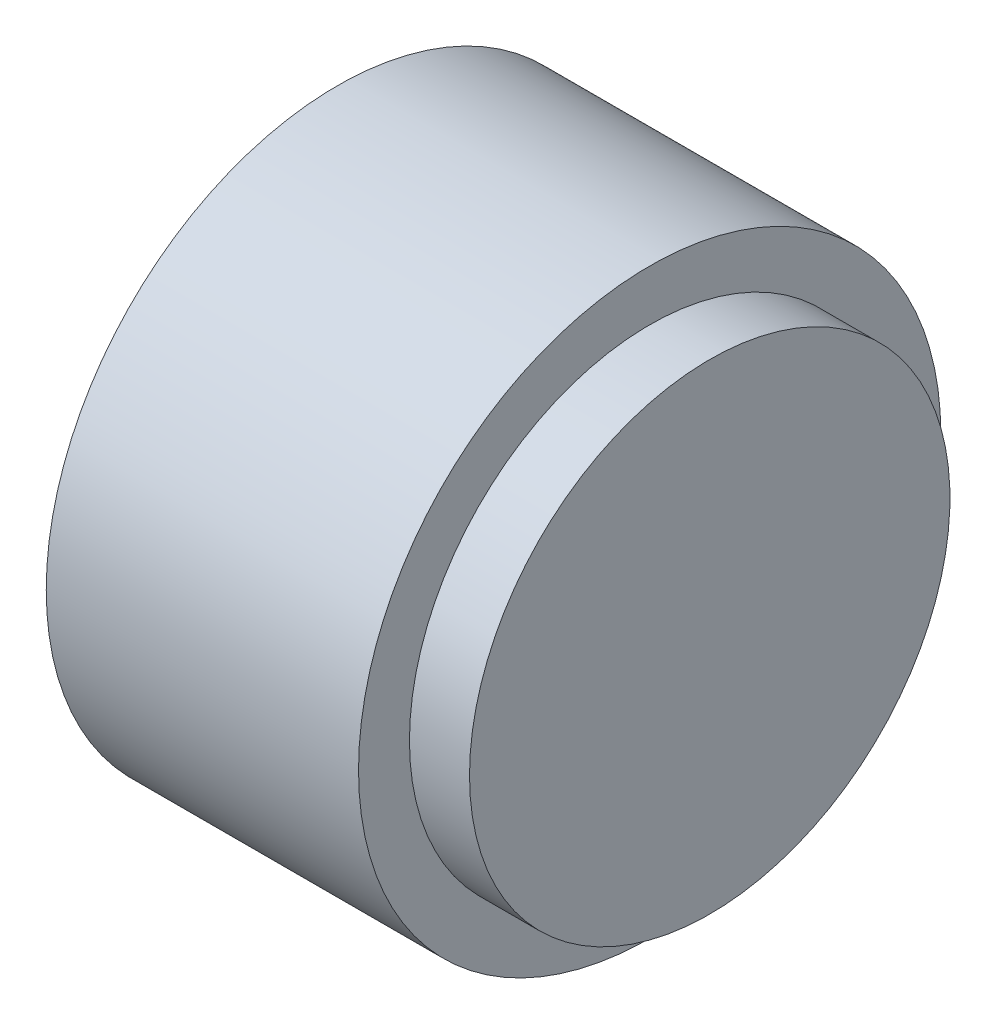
from build123d import *


with BuildPart() as part:
    # Sketch2 → Base-Revolve (revolve)
    with BuildSketch(Plane.XY, mode=Mode.PRIVATE) as base_revolve_sk:
        Polygon((0, 0), (39.37, 0), (39.37, 25.4), (33.02, 25.4), (33.02, 30.7848), (0, 30.7848), align=None)
    revolve(base_revolve_sk.sketch.rotate(Axis((-81.451207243, 0, 0), (1, 0, 0)), 90), axis=Axis((-81.451207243, 0, 0), (1, 0, 0)))


solid = part.part
